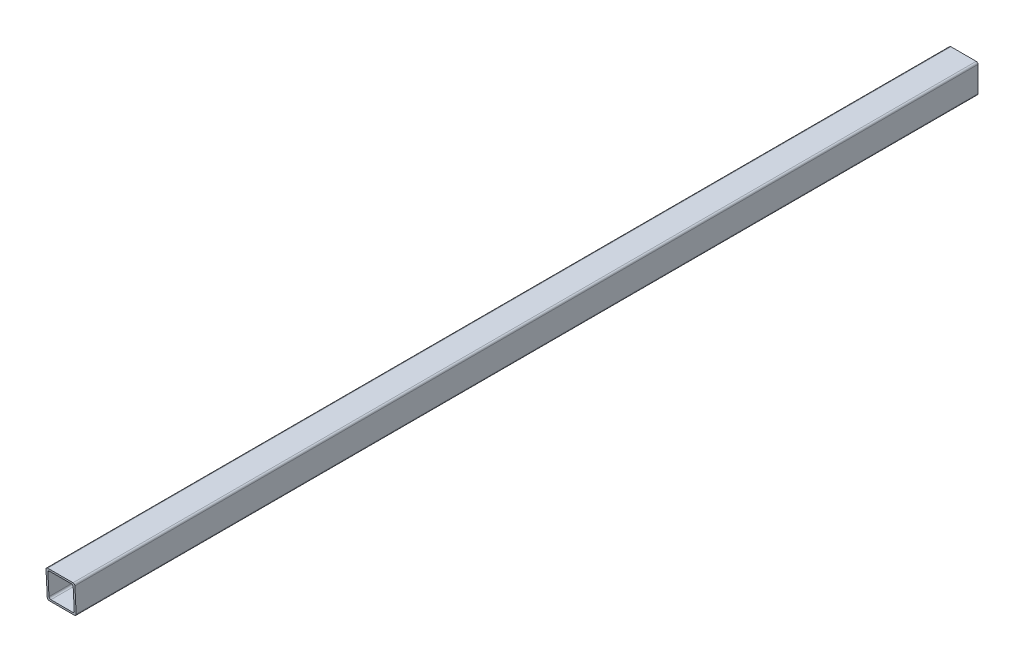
from build123d import *

# Parameters (mm, degrees)
ESQUISSE1_W             = 80
ESQUISSE1_H             = 80
ESQUISSE1_W_2           = 70
ESQUISSE1_H_2           = 70
BOSS_EXTRU_1_DEPTH      = 3000
ENL_V_MAT_EXTRU_1_DEPTH = 3002.333037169
CONG_1_R                = 5


with BuildPart() as part:
    # Esquisse1 → Boss.-Extru.1 (new body)
    with BuildSketch(Plane.XY):
        Rectangle(ESQUISSE1_W, ESQUISSE1_H)
        Rectangle(ESQUISSE1_W_2, ESQUISSE1_H_2, mode=Mode.SUBTRACT)
    extrude(amount=BOSS_EXTRU_1_DEPTH)

    # Esquisse2 → Enl_v. mat.-Extru.1 (cut, through all)
    with BuildSketch(Plane(origin=(40, 0, 0), x_dir=(0, 0, -1), z_dir=(1, 0, 0))):
        Polygon((-2496, -40), (-2502.422853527, 88.45730546), (-2684.30029306, 85.605527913), (-3003.814948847, 85.605527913), (-3008.682304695, -78.3989656), align=None)
    extrude(amount=-ENL_V_MAT_EXTRU_1_DEPTH, mode=Mode.SUBTRACT)

    # Cong_1
    cong_1_edges = [part.edges().sort_by_distance(p)[0] for p in [
        (35, 35, 1249.874996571),
        (-35, 35, 1249.874996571),
        (35, -35, 1248.124999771),
        (-35, -35, 1248.124999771),
        (-40, 40, 1249.999996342),
        (40, 40, 1249.999996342),
        (40, -40, 1248),
        (-40, -40, 1248),
    ]]
    fillet(cong_1_edges, radius=CONG_1_R)


solid = part.part
